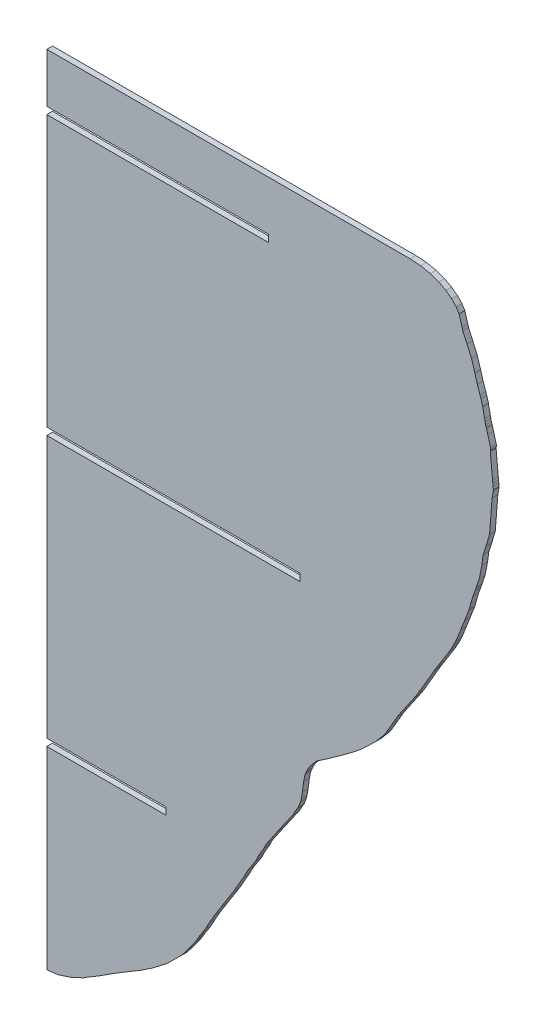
from build123d import *

# Parameters (mm, degrees)
EXTRUDE_1_DEPTH = 2


with BuildPart() as part:
    # Model → Extrude 1 (new body)
    with BuildSketch(Plane.XY):
        Polygon((-5408.4533, -53.9262), (-5408.463, -53.9437), (-5408.4718, -53.9596), (-5408.4806, -53.9755), (-5408.4894, -53.9913), (-5409.1195, -54.9242), (-5410.8983, -57.4753), (-5410.9894, -57.5922), (-5411.0807, -57.709), (-5413.3844, -60.7014), (-5414.0084, -61.4408), (-5414.024, -61.4565), (-5414.0294, -61.4617), (-5414.0685, -61.5079), (-5414.8509, -62.2709), (-5418.4608, -65.8267), (-5418.8163, -66.1727), (-5419.3741, -66.633), (-5420.2789, -67.3157), (-5423.8468, -70.0482), (-5424.1168, -70.2341), (-5424.3868, -70.4199), (-5424.9066, -70.7563), (-5428.1244, -72.8907), (-5432.2049, -75.3166), (-5437.9562, -78.8179), (-5442.8224, -81.9632), (-5446.2811, -84.0007), (-5448.3084, -85.2973), (-5448.5687, -85.3841), (-5448.829, -85.471), (-5451.6651, -86.8804), (-5451.7237, -86.9102), (-5451.7826, -86.9399), (-5452.0123, -87.0112), (-5452.242, -87.0825), (-5453.0887, -87.3597), (-5456.7367, -88.5353), (-5457.742, -88.7161), (-5458.4408, -88.7665), (-5460.7386, -89.0461), (-5460.7386, -21.5439), (-5419.2267, -21.5439), (-5419.2267, -21.2939), (-5419.2267, -19.2939), (-5419.2267, -19.0439), (-5460.7386, -19.0439), (-5460.7386, 72.4255), (-5372.4449, 72.4255), (-5372.4449, 74.9255), (-5460.7386, 74.9255), (-5460.7386, 169.3754), (-5383.3607, 169.3754), (-5383.3607, 169.6028), (-5383.3607, 171.6028), (-5383.3607, 171.8754), (-5460.7386, 171.8754), (-5460.7386, 189.083), (-5333.9532, 189.1549), (-5330.2684, 188.9062), (-5326.9486, 188.2157), (-5324.0255, 187.1674), (-5321.5304, 185.845), (-5319.4945, 184.3322), (-5317.9493, 182.7128), (-5316.9264, 181.0705), (-5315.868, 177.5103), (-5315.6253, 176.5949), (-5314.1493, 173.3449), (-5312.5677, 169.7051), (-5311.4491, 166.0962), (-5311.4469, 166.0885), (-5311.4447, 166.0808), (-5311.4427, 166.0731), (-5311.4405, 166.0655), (-5311.3573, 165.8047), (-5310.5423, 162.9632), (-5309.6183, 160.2642), (-5309.2857, 159.3144), (-5308.7003, 157.3245), (-5308.6732, 157.1728), (-5308.6458, 157.021), (-5308.013, 153.854), (-5307.8294, 152.9604), (-5307.6456, 152.0666), (-5307.4442, 151.5232), (-5307.4205, 151.4395), (-5307.3968, 151.3558), (-5307.3624, 151.2614), (-5307.3277, 151.167), (-5306.8912, 149.5739), (-5305.9496, 146.2538), (-5305.9352, 145.953), (-5305.9208, 145.6523), (-5305.921, 145.6505), (-5305.9212, 145.6487), (-5305.9168, 145.5624), (-5306.0165, 144.9763), (-5305.2481, 136.7716), (-5305.1539, 135.7981), (-5305.0594, 134.8245), (-5304.9298, 133.8442), (-5304.9308, 133.8384), (-5304.9312, 133.8355), (-5304.932, 133.8326), (-5304.9315, 133.8288), (-5304.9308, 133.8249), (-5304.9298, 133.8172), (-5305.3985, 131.1886), (-5306.2677, 119.8442), (-5307.5025, 115.5524), (-5308.5406, 112.4017), (-5308.9669, 109.0915), (-5309.8622, 104.5376), (-5310.8717, 101.5689), (-5311.0902, 100.9117), (-5311.3089, 100.2546), (-5312.1192, 98.0953), (-5312.8839, 95.3962), (-5313.099, 94.5842), (-5313.3141, 93.7722), (-5313.3697, 93.6278), (-5313.4256, 93.4833), (-5313.452, 93.39), (-5313.4784, 93.2968), (-5314.9654, 89.4489), (-5316.4195, 85.7405), (-5317.7162, 82.393), (-5318.3084, 81.1741), (-5318.8653, 79.9984), (-5319.5746, 78.6669), (-5320.412, 77.197), (-5320.4183, 77.1868), (-5320.4247, 77.1766), (-5320.441, 77.1477), (-5320.4574, 77.1188), (-5323.8727, 71.6995), (-5324.6659, 70.4396), (-5324.8832, 70.103), (-5325.1004, 69.7664), (-5325.2906, 69.4369), (-5325.4811, 69.1074), (-5331.1903, 59.3462), (-5332.3253, 57.5837), (-5332.3282, 57.5794), (-5332.3338, 57.5706), (-5332.3397, 57.5619), (-5332.3509, 57.5444), (-5332.5057, 57.3196), (-5332.5575, 57.2446), (-5338.3238, 48.8214), (-5338.4771, 48.5474), (-5338.6305, 48.2733), (-5340.0233, 45.8617), (-5342.4859, 41.6596), (-5342.9254, 40.9603), (-5343.3731, 40.4037), (-5345.9649, 37.3416), (-5348.4715, 34.9072), (-5351.4029, 32.173), (-5354.1385, 29.9819), (-5357.098, 27.7893), (-5357.2799, 27.6466), (-5357.462, 27.5196), (-5358.0538, 27.0812), (-5363.5501, 23.1794), (-5366.389, 21.2743), (-5366.9491, 20.6846), (-5369.026, 18.3012), (-5370.0636, 16.3315), (-5370.3729, 15.6387), (-5370.6822, 14.9458), (-5371.1605, 12.5537), (-5371.5916, 9.1919), (-5371.9801, 6.8961), (-5372.2298, 5.9779), (-5373.0055, 3.9587), (-5373.2813, 3.5076), (-5373.5575, 3.0564), (-5374.7357, 0.943), (-5379.7845, -6.2948), (-5380.3265, -7.0549), (-5380.3746, -7.1404), (-5380.4227, -7.2257), (-5384.2474, -12.818), (-5384.6278, -13.6564), (-5385.055, -14.5616), (-5386.9828, -17.8335), (-5387.347, -18.642), (-5387.7113, -19.4503), (-5389.7955, -22.6691), (-5390.4735, -23.6866), (-5392.1175, -26.7395), (-5395.6153, -32.8334), (-5399.7254, -39.3247), (-5402.4117, -43.6007), (-5403.8741, -46.1775), (-5405.4017, -48.9737), (-5406.4737, -50.7237), (-5406.4796, -50.7322), (-5406.4854, -50.7406), (-5406.4911, -50.749), (-5406.4969, -50.7574), (-5406.5045, -50.7698), (-5406.5121, -50.7822), (-5406.5194, -50.7945), (-5406.527, -50.8069), (-5406.9786, -51.4635), (-5407.4303, -52.1201), (-5407.704, -52.5909), (-5407.9779, -53.0617), (-5408.1908, -53.4486), (-5408.4037, -53.8356), (-5408.4156, -53.8578), (-5408.4278, -53.8801), (-5408.44, -53.9023), align=None)
    extrude(amount=EXTRUDE_1_DEPTH)


solid = part.part
